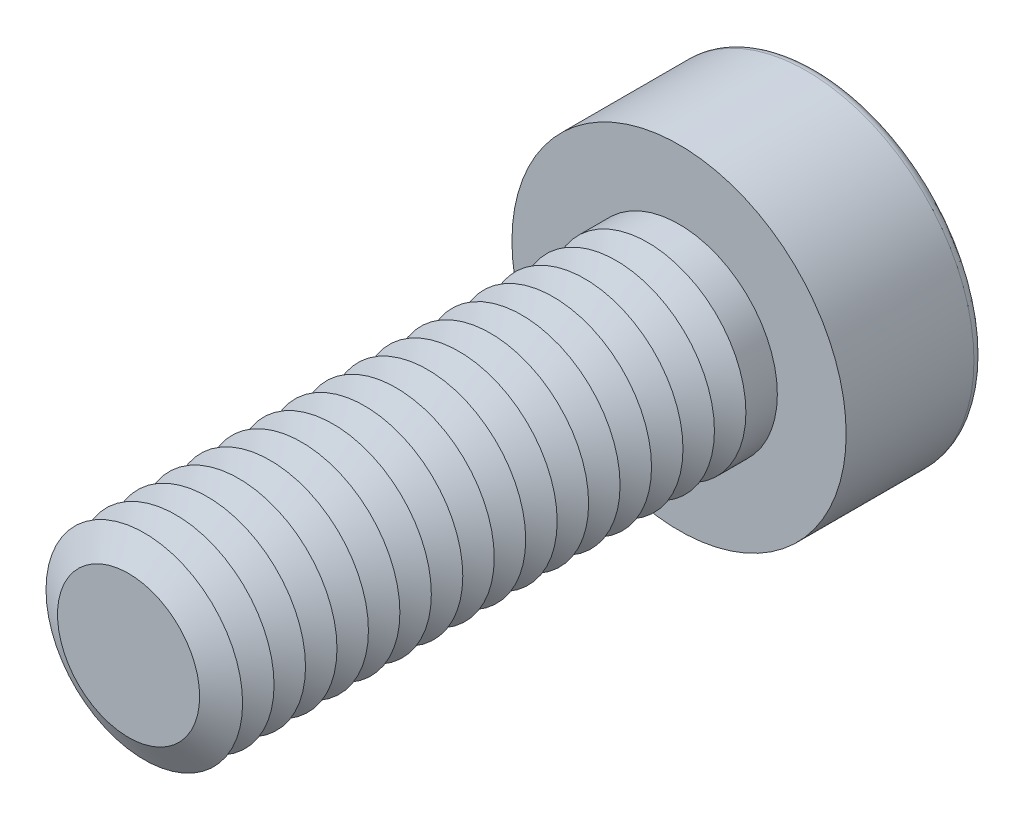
from build123d import *

# Parameters (mm, degrees)
SKETCH1_R           = 2.5
BOSS_EXTRUDE1_DEPTH = 14
SKETCH2_R           = 4.25
BOSS_EXTRUDE2_DEPTH = 3.5
CUT_EXTRUDE1_DEPTH  = 2.25
FILLET1_R           = 0.25
LPATTERN1_COUNT     = 17
LPATTERN1_PITCH     = 0.8


with BuildPart() as part:
    # Sketch1 → Boss-Extrude1 (new body)
    with BuildSketch(Plane.XY):
        Circle(SKETCH1_R)
    extrude(amount=BOSS_EXTRUDE1_DEPTH)

    # Sketch2 → Boss-Extrude2 (add)
    with BuildSketch(Plane(origin=(0, 0, 0), x_dir=(-1, 0, 0), z_dir=(0, 0, -1))):
        Circle(SKETCH2_R)
    extrude(amount=BOSS_EXTRUDE2_DEPTH)

    # Sketch3 → Cut-Extrude1 (cut)
    with BuildSketch(Plane(origin=(0, 0, -3.5), x_dir=(-1, 0, 0), z_dir=(0, 0, -1))):
        Polygon((-0.866025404, 1.5), (-1.732050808, 0), (-0.866025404, -1.5), (0.866025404, -1.5), (1.732050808, 0), (0.866025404, 1.5), align=None)
    extrude(amount=-CUT_EXTRUDE1_DEPTH, mode=Mode.SUBTRACT)

    # Fillet1
    fillet1_edges = [part.edges().sort_by_distance(p)[0] for p in [
        (4.25, 0, -3.5),
    ]]
    fillet(fillet1_edges, radius=FILLET1_R)

    # Cut-Extrude2 cone 1 section (on through the dimple's axis) → Cut-Extrude2 (revolve, cut)
    with BuildSketch(Plane(origin=(0, 0, -1.25), x_dir=(0, 1, 0), z_dir=(1, 0, 0))):
        Polygon((0, 0), (1.5, 0), (0, 0.866025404), align=None)
    revolve(axis=Axis((0, 0, -1.25), (0, 0, 1)), mode=Mode.SUBTRACT)

    # Cut-Extrude3 cone 1 section (on through the dimple's axis) → Cut-Extrude3 (revolve, cut)
    with BuildSketch(Plane(origin=(0, 0, -3.5), x_dir=(0, 1, 0), z_dir=(1, 0, 0))):
        Polygon((0, 0), (1.732050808, 0), (0, 0.464101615), align=None)
    revolve(axis=Axis((0, 0, -3.5), (0, 0, 1)), mode=Mode.SUBTRACT)

    # Sketch7 → Cut-Revolve1 (revolve, cut)
    with BuildSketch(Plane(origin=(0, 0, 0), x_dir=(0, 0, -1), z_dir=(1, 0, 0)), mode=Mode.PRIVATE) as cut_revolve1_sk:
        Polygon((-14, 1.807179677), (-13.6, 2.5), (-14.4, 2.5), align=None)
    cut_revolve1 = revolve(cut_revolve1_sk.sketch.rotate(Axis((0, 0, 14), (0, 0, -1)), 90), axis=Axis((0, 0, 14), (0, 0, -1)), mode=Mode.SUBTRACT)

    # LPattern1: Cut-Revolve1 ×17
    with Locations(*[(0, 0, -i * LPATTERN1_PITCH) for i in range(1, LPATTERN1_COUNT)]):
        add(cut_revolve1, mode=Mode.SUBTRACT)


solid = part.part
